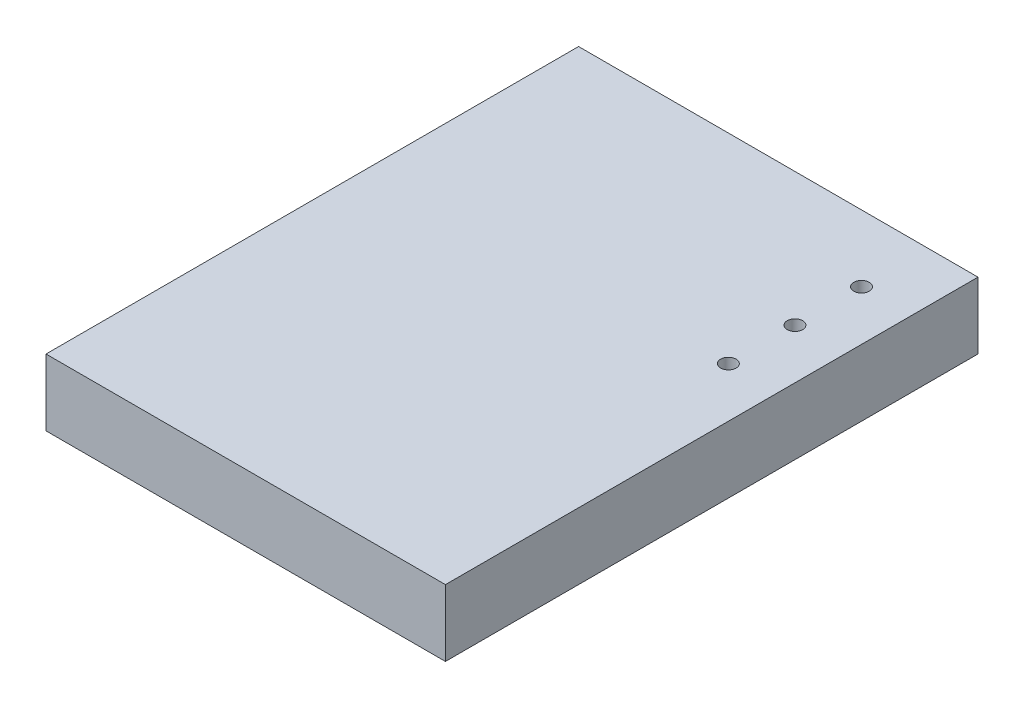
from build123d import *

# Parameters (mm, degrees)
SKETCH1_W               = 76.2
SKETCH1_H               = 101.6
BOSS_EXTRUDE1_DEPTH     = 12.7
CUT_EXTRUDE1_DEPTH      = 128.633420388
CUT_EXTRUDE1_DEPTH_BACK = 128.633420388
SKETCH2_R               = 1.48


with BuildPart() as part:
    # Sketch1 → Boss-Extrude1 (new body)
    with BuildSketch(Plane(origin=(0, 0, 0), x_dir=(1, 0, 0), z_dir=(0, 1, 0))):
        with Locations((38.1, -50.8)):
            Rectangle(SKETCH1_W, SKETCH1_H)
    extrude(amount=BOSS_EXTRUDE1_DEPTH)

    # Sketch2 → Cut-Extrude1 (cut, two sides: drawn at the far end of the back side and taken through both)
    with BuildSketch(Plane(origin=(0, 12.7, 0), x_dir=(1, 0, 0), z_dir=(0, 1, 0)).offset(-CUT_EXTRUDE1_DEPTH_BACK)):
        with Locations(Location((66.675, -12.7, 0), (0, 0, 270))):
            Circle(SKETCH2_R)
        with Locations(Location((66.675, -25.4, 0), (0, 0, 270))):
            Circle(SKETCH2_R)
        with Locations(Location((66.675, -38.1, 0), (0, 0, 270))):
            Circle(SKETCH2_R)
    extrude(amount=CUT_EXTRUDE1_DEPTH + CUT_EXTRUDE1_DEPTH_BACK, mode=Mode.SUBTRACT)


solid = part.part
